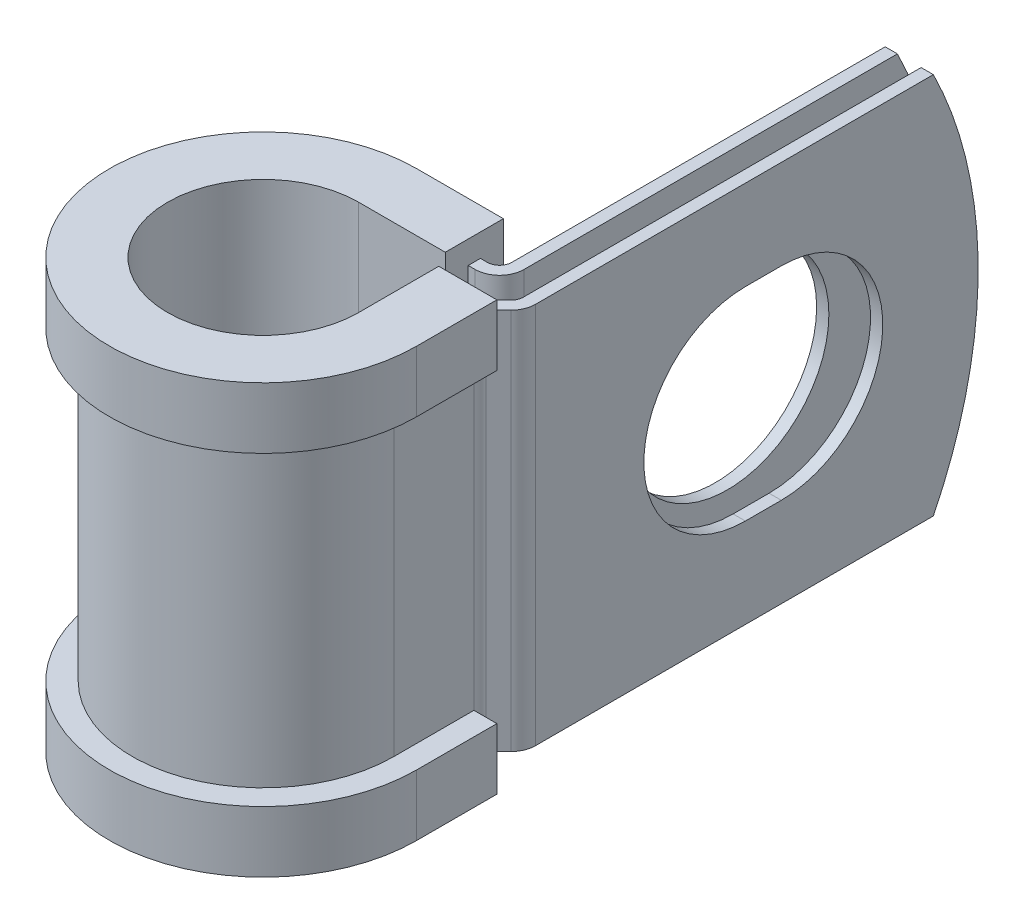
from build123d import *

# Parameters (mm, degrees)
EXTRUDE_THIN1_DEPTH = 12.7
SKETCH2_R           = 6.7437
CUT_EXTRUDE1_DEPTH  = 0.8128
CUT_EXTRUDE2_DEPTH  = 0.8128
CUT_EXTRUDE3_DEPTH  = 43.409217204


with BuildPart() as part:
    # Sketch1 → Extrude-Thin1 (new, symmetric)
    with BuildSketch(Plane(origin=(0, 0, 0), x_dir=(1, 0, 0), z_dir=(0, 1, 0))):
        with BuildLine():
            Line((9.414374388, 37.2872), (9.414374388, 7.874))
            ThreePointArc((9.414374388, 7.874), (9.352503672, 7.562954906), (9.17631078, 7.299263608))
            Line((9.17631078, 7.299263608), (8.350127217, 6.473080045))
            ThreePointArc((8.350127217, 6.473080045), (7.997741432, 5.945697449), (7.874, 5.323607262))
            Line((7.874, 5.323607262), (7.874, 0))
            ThreePointArc((7.874, 0), (-5.567758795, -5.567758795), (0, 7.874))
            Line((0, 7.874), (6.213974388, 7.874))
            ThreePointArc((6.213974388, 7.874), (7.363447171, 8.350127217), (7.839574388, 9.4996))
            Line((7.839574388, 9.4996), (7.839574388, 37.2872))
            Line((7.839574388, 37.2872), (7.026774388, 37.2872))
            Line((7.026774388, 37.2872), (7.026774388, 9.4996))
            ThreePointArc((7.026774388, 9.4996), (6.78871078, 8.924863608), (6.213974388, 8.6868))
            Line((6.213974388, 8.6868), (0, 8.6868))
            ThreePointArc((0, 8.6868), (-6.142495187, -6.142495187), (8.6868, 0))
            Line((8.6868, 0), (8.6868, 5.323607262))
            ThreePointArc((8.6868, 5.323607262), (8.748670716, 5.634652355), (8.924863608, 5.898343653))
            Line((8.924863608, 5.898343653), (9.751047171, 6.724527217))
            ThreePointArc((9.751047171, 6.724527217), (10.103432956, 7.251909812), (10.227174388, 7.874))
            Line((10.227174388, 7.874), (10.227174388, 37.2872))
            Line((10.227174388, 37.2872), (9.414374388, 37.2872))
        make_face()
    extrude(amount=EXTRUDE_THIN1_DEPTH, both=True)

    # Sketch2 → Cut-Extrude1 (cut)
    with BuildSketch(Plane.ZY.offset(-7.026774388)):
        with Locations((-23.0124, 0)):
            Circle(SKETCH2_R)
    extrude(amount=-CUT_EXTRUDE1_DEPTH, mode=Mode.SUBTRACT)

    # Sketch3 → Cut-Extrude2 (cut)
    with BuildSketch(Plane(origin=(10.227174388, 0, 0), x_dir=(0, 0, -1), z_dir=(1, 0, 0))):
        with BuildLine():
            Line((21.8186, 6.7437), (24.2062, 6.7437))
            ThreePointArc((24.2062, 6.7437), (30.9499, 0), (24.2062, -6.7437))
            Line((24.2062, -6.7437), (21.8186, -6.7437))
            ThreePointArc((21.8186, -6.7437), (15.0749, 0), (21.8186, 6.7437))
        make_face()
    extrude(amount=-CUT_EXTRUDE2_DEPTH, mode=Mode.SUBTRACT)

    # Sketch4 → Cut-Extrude3 (cut, through all)
    with BuildSketch(Plane.ZY.offset(-7.026774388)):
        with BuildLine():
            Line((-34.309868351, 12.7), (-37.2872, 12.7))
            Line((-37.2872, 12.7), (-37.2872, 0))
            ThreePointArc((-37.2872, 0), (-36.532911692, 6.522164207), (-34.309868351, 12.7))
        make_face()
        with BuildLine():
            ThreePointArc((-34.309868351, -12.7), (-36.532911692, -6.522164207), (-37.2872, 0))
            Line((-37.2872, 0), (-37.2872, -12.7))
            Line((-37.2872, -12.7), (-34.309868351, -12.7))
        make_face()
    extrude(amount=-CUT_EXTRUDE3_DEPTH, mode=Mode.SUBTRACT)

    # Sweep1: sweep along a path in Sketch6
    with BuildLine(Plane(origin=(0, 12.7, 0), x_dir=(1, 0, 0), z_dir=(0, 1, 0))) as sweep1_path:
        Line((6.35, 5.323607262), (6.35, 0))
        ThreePointArc((6.35, 0), (-4.490128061, -4.490128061), (0, 6.35))
        Line((0, 6.35), (5.756774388, 6.35))
    # Sketch5 → Sweep1 (sweep)
    with BuildSketch(Plane(origin=(0, 0, -5.323607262), x_dir=(-1, 0, 0), z_dir=(0, 0, -1))):
        Polygon((-8.6868, 12.7), (-7.874, 12.7), (-7.874, -12.7), (-8.6868, -12.7), (-8.6868, -10.16), (-10.2108, -10.16), (-10.2108, -14.224), (-6.35, -14.224), (-6.35, 14.224), (-10.2108, 14.224), (-10.2108, 10.16), (-8.6868, 10.16), align=None)
    sweep(path=sweep1_path.line)


solid = part.part
